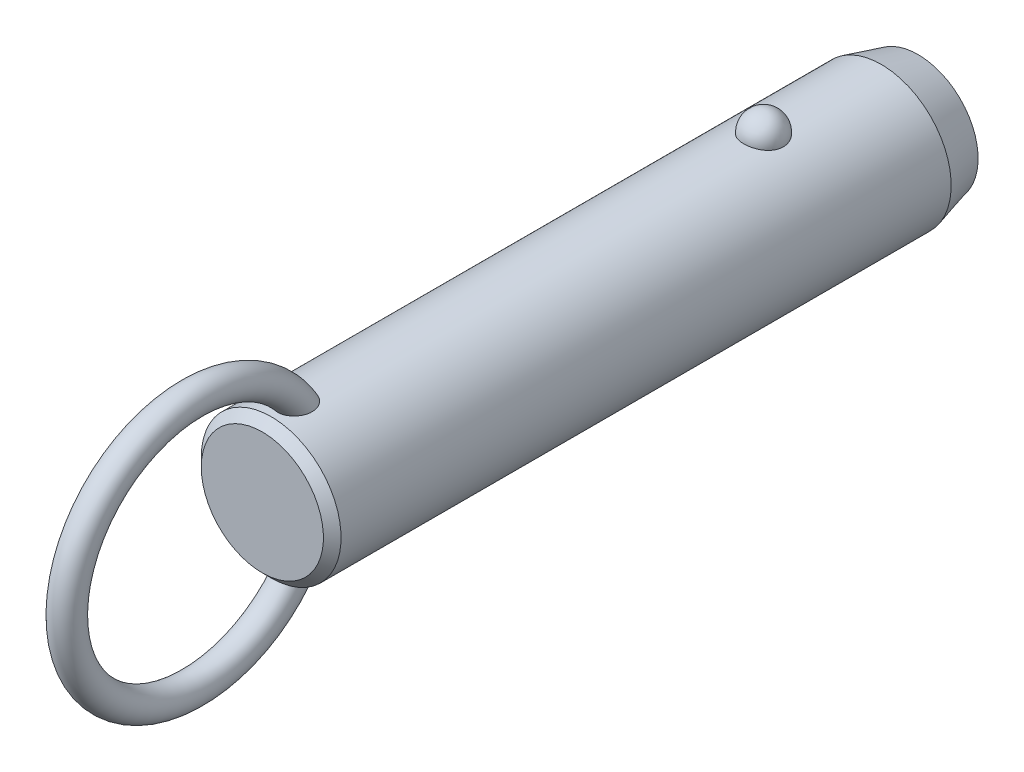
ISO-10303-21;
HEADER;
FILE_DESCRIPTION(('STEP AP214'),'2;1');
FILE_NAME('part.step','',(''),(''),'','','');
FILE_SCHEMA(('AUTOMOTIVE_DESIGN { 1 0 10303 214 1 1 1 1 }'));
ENDSEC;
DATA;
#1=APPLICATION_CONTEXT('core data for automotive mechanical design processes');
#2=APPLICATION_PROTOCOL_DEFINITION('international standard','automotive_design',2000,#1);
#3=PRODUCT_CONTEXT('',#1,'mechanical');
#4=PRODUCT('Part','Part','',(#3));
#5=PRODUCT_RELATED_PRODUCT_CATEGORY('part','',(#4));
#6=PRODUCT_DEFINITION_FORMATION('','',#4);
#7=PRODUCT_DEFINITION_CONTEXT('part definition',#1,'design');
#8=PRODUCT_DEFINITION('design','',#6,#7);
#9=PRODUCT_DEFINITION_SHAPE('','',#8);
#10=(LENGTH_UNIT() NAMED_UNIT(*) SI_UNIT(.MILLI.,.METRE.));
#11=(NAMED_UNIT(*) PLANE_ANGLE_UNIT() SI_UNIT($,.RADIAN.));
#12=(NAMED_UNIT(*) SI_UNIT($,.STERADIAN.) SOLID_ANGLE_UNIT());
#13=UNCERTAINTY_MEASURE_WITH_UNIT(LENGTH_MEASURE(1.E-05),#10,'distance_accuracy_value','');
#14=(GEOMETRIC_REPRESENTATION_CONTEXT(3) GLOBAL_UNCERTAINTY_ASSIGNED_CONTEXT((#13)) GLOBAL_UNIT_ASSIGNED_CONTEXT((#10,
#11,#12)) REPRESENTATION_CONTEXT('',''));
#15=CARTESIAN_POINT('',(0.,0.,0.));
#16=DIRECTION('',(0.,0.,1.));
#17=DIRECTION('',(1.,0.,0.));
#18=AXIS2_PLACEMENT_3D('',#15,#16,#17);
#19=CARTESIAN_POINT('',(0.,0.,55.9));
#20=DIRECTION('',(0.,0.,-1.));
#21=DIRECTION('',(-1.,0.,0.));
#22=AXIS2_PLACEMENT_3D('',#19,#20,#21);
#23=CYLINDRICAL_SURFACE('',#22,9.5);
#24=CARTESIAN_POINT('',(2.67259918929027,9.11631578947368,-2.7));
#25=CARTESIAN_POINT('',(2.6725968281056,9.11631786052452,-2.54909854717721));
#26=CARTESIAN_POINT('',(2.66030567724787,9.11994722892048,-2.39816735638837));
#27=CARTESIAN_POINT('',(2.6114347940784,9.13405924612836,-2.10058568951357));
#28=CARTESIAN_POINT('',(2.57484658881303,9.14454428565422,-1.9539367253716));
#29=CARTESIAN_POINT('',(2.47830875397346,9.17117631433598,-1.66916069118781));
#30=CARTESIAN_POINT('',(2.41836936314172,9.18732082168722,-1.53102991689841));
#31=CARTESIAN_POINT('',(2.27661331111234,9.22346780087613,-1.26705393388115));
#32=CARTESIAN_POINT('',(2.19479699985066,9.24347021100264,-1.14120852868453));
#33=CARTESIAN_POINT('',(2.01085282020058,9.28522401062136,-0.904632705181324));
#34=CARTESIAN_POINT('',(1.90862396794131,9.30698376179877,-0.79398224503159));
#35=CARTESIAN_POINT('',(1.6867437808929,9.34973971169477,-0.591607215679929));
#36=CARTESIAN_POINT('',(1.56709244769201,9.37073591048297,-0.499882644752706));
#37=CARTESIAN_POINT('',(1.31393976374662,9.40956370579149,-0.338167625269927));
#38=CARTESIAN_POINT('',(1.18048026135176,9.42740444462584,-0.268113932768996));
#39=CARTESIAN_POINT('',(0.903154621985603,9.45799906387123,-0.151390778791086));
#40=CARTESIAN_POINT('',(0.759289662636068,9.47075351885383,-0.104718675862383));
#41=CARTESIAN_POINT('',(0.468074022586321,9.48956256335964,-0.0367633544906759));
#42=CARTESIAN_POINT('',(0.320836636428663,9.49573643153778,-0.0150275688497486));
#43=CARTESIAN_POINT('',(0.0246714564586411,9.50112183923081,0.00396199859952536));
#44=CARTESIAN_POINT('',(-0.124256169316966,9.50033406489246,0.00121819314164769));
#45=CARTESIAN_POINT('',(-0.417264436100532,9.4919475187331,-0.0284441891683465));
#46=CARTESIAN_POINT('',(-0.56138413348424,9.48444885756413,-0.0550074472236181));
#47=CARTESIAN_POINT('',(-0.842986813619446,9.46357853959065,-0.131064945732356));
#48=CARTESIAN_POINT('',(-0.980469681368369,9.450206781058,-0.180559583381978));
#49=CARTESIAN_POINT('',(-1.24585005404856,9.41890822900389,-0.30147637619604));
#50=CARTESIAN_POINT('',(-1.37368611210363,9.40095498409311,-0.373026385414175));
#51=CARTESIAN_POINT('',(-1.61552738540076,9.36242964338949,-0.536025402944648));
#52=CARTESIAN_POINT('',(-1.72953116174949,9.34185727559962,-0.627476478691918));
#53=CARTESIAN_POINT('',(-1.9429225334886,9.29984568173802,-0.829844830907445));
#54=CARTESIAN_POINT('',(-2.04198021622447,9.27839736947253,-0.941108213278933));
#55=CARTESIAN_POINT('',(-2.22026460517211,9.23735994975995,-1.17883414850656));
#56=CARTESIAN_POINT('',(-2.29948985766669,9.21777097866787,-1.30529781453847));
#57=CARTESIAN_POINT('',(-2.43697287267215,9.18238994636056,-1.57158566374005));
#58=CARTESIAN_POINT('',(-2.49497068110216,9.16664569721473,-1.71155057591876));
#59=CARTESIAN_POINT('',(-2.5872073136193,9.14104303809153,-1.99961197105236));
#60=CARTESIAN_POINT('',(-2.62144683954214,9.13118445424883,-2.14770821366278));
#61=CARTESIAN_POINT('',(-2.66521466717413,9.11850622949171,-2.44715424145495));
#62=CARTESIAN_POINT('',(-2.67484831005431,9.11565658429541,-2.59848735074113));
#63=CARTESIAN_POINT('',(-2.66946735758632,9.11723375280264,-2.90067317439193));
#64=CARTESIAN_POINT('',(-2.65445345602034,9.12166036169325,-3.05152590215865));
#65=CARTESIAN_POINT('',(-2.60029711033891,9.13724422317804,-3.34766110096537));
#66=CARTESIAN_POINT('',(-2.56127978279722,9.14836656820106,-3.49296833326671));
#67=CARTESIAN_POINT('',(-2.46018844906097,9.17606676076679,-3.77477535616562));
#68=CARTESIAN_POINT('',(-2.39811349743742,9.1926448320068,-3.9112747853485));
#69=CARTESIAN_POINT('',(-2.25202303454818,9.22952198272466,-4.17244273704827));
#70=CARTESIAN_POINT('',(-2.16788714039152,9.24984129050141,-4.29704106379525));
#71=CARTESIAN_POINT('',(-1.9799408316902,9.29188255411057,-4.53013066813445));
#72=CARTESIAN_POINT('',(-1.87612963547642,9.31360456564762,-4.63862130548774));
#73=CARTESIAN_POINT('',(-1.65105429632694,9.35612959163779,-4.8369029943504));
#74=CARTESIAN_POINT('',(-1.52972405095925,9.37692871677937,-4.92661991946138));
#75=CARTESIAN_POINT('',(-1.27318250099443,9.41518970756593,-5.08429106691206));
#76=CARTESIAN_POINT('',(-1.13797219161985,9.432651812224,-5.15224684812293));
#77=CARTESIAN_POINT('',(-0.859280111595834,9.46208255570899,-5.26371827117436));
#78=CARTESIAN_POINT('',(-0.715925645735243,9.47411833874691,-5.30753421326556));
#79=CARTESIAN_POINT('',(-0.423550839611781,9.4916822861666,-5.37076321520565));
#80=CARTESIAN_POINT('',(-0.2745312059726,9.49721125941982,-5.39017930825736));
#81=CARTESIAN_POINT('',(0.0218446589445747,9.50110860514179,-5.40390587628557));
#82=CARTESIAN_POINT('',(0.16917707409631,9.49961381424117,-5.39869609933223));
#83=CARTESIAN_POINT('',(0.460808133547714,9.48993906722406,-5.3644195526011));
#84=CARTESIAN_POINT('',(0.605106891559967,9.48175936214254,-5.33535367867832));
#85=CARTESIAN_POINT('',(0.886027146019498,9.4596376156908,-5.2543558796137));
#86=CARTESIAN_POINT('',(1.02267710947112,9.44571881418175,-5.20251612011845));
#87=CARTESIAN_POINT('',(1.28523827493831,9.41358993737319,-5.07741549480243));
#88=CARTESIAN_POINT('',(1.41114877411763,9.39537958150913,-5.0041532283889));
#89=CARTESIAN_POINT('',(1.65085227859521,9.3562644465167,-4.83684599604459));
#90=CARTESIAN_POINT('',(1.76442346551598,9.33532178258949,-4.74249218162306));
#91=CARTESIAN_POINT('',(1.97425672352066,9.29321198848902,-4.53620389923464));
#92=CARTESIAN_POINT('',(2.07051582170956,9.27204482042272,-4.42426641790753));
#93=CARTESIAN_POINT('',(2.24490086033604,9.23139221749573,-4.18363183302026));
#94=CARTESIAN_POINT('',(2.32267019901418,9.21194380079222,-4.05466990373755));
#95=CARTESIAN_POINT('',(2.45584092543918,9.1773419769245,-3.78517836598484));
#96=CARTESIAN_POINT('',(2.5112497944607,9.16218713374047,-3.64465264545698));
#97=CARTESIAN_POINT('',(2.59380876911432,9.13913522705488,-3.37104301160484));
#98=CARTESIAN_POINT('',(2.62330266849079,9.13064624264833,-3.23871053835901));
#99=CARTESIAN_POINT('',(2.66269870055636,9.11923566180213,-2.97092664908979));
#100=CARTESIAN_POINT('',(2.67260130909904,9.11631393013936,-2.8354753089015));
#101=CARTESIAN_POINT('',(2.67259918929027,9.11631578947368,-2.7));
#102=B_SPLINE_CURVE_WITH_KNOTS('',3,(#24,#25,#26,#27,#28,#29,#30,#31,#32,#33,#34,#35,#36,#37,
#38,#39,#40,#41,#42,#43,#44,#45,#46,#47,#48,#49,#50,#51,#52,#53,#54,#55,#56,#57,#58,#59,#60,#61,
#62,#63,#64,#65,#66,#67,#68,#69,#70,#71,#72,#73,#74,#75,#76,#77,#78,#79,#80,#81,#82,#83,#84,#85,
#86,#87,#88,#89,#90,#91,#92,#93,#94,#95,#96,#97,#98,#99,#100,#101),.UNSPECIFIED.,.T.,.F.,(4,2,2,
2,2,2,2,2,2,2,2,2,2,2,2,2,2,2,2,2,2,2,2,2,2,2,2,2,2,2,2,2,2,2,2,2,2,2,4),(0.,0.452217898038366,
0.904593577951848,1.35677112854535,1.80894144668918,2.26340676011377,2.71787203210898,
3.17099820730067,3.62407318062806,4.0687883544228,4.51345969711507,4.95160616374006,
5.38976021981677,5.83050358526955,6.27129275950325,6.72071308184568,7.17016633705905,
7.62495278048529,8.07972578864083,8.53254856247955,8.98535859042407,9.43582813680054,
9.88631615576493,10.3393155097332,10.7923328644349,11.2471065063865,11.7018475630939,
12.150795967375,12.599688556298,13.0398725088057,13.4800399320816,13.9184421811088,
14.3568730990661,14.802202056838,15.2476074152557,15.7010097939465,16.1542603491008,
16.5602594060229,16.966248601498),.UNSPECIFIED.);
#103=CARTESIAN_POINT('',(2.67259918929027,9.11631578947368,-2.7));
#104=VERTEX_POINT('',#103);
#105=EDGE_CURVE('E41',#104,#104,#102,.T.);
#106=ORIENTED_EDGE('',*,*,#105,.T.);
#107=EDGE_LOOP('',(#106));
#108=FACE_BOUND('',#107,.T.);
#109=CARTESIAN_POINT('',(0.,0.,64.22));
#110=DIRECTION('',(0.,0.,1.));
#111=DIRECTION('',(1.,0.,0.));
#112=AXIS2_PLACEMENT_3D('',#109,#110,#111);
#113=CIRCLE('',#112,9.5);
#114=CARTESIAN_POINT('',(-9.50000000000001,0.,64.22));
#115=VERTEX_POINT('',#114);
#116=EDGE_CURVE('E10',#115,#115,#113,.F.);
#117=ORIENTED_EDGE('',*,*,#116,.T.);
#118=EDGE_LOOP('',(#117));
#119=FACE_BOUND('',#118,.T.);
#120=CARTESIAN_POINT('',(-0.697062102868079,-9.47439269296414,58.5678088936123));
#121=CARTESIAN_POINT('',(-0.799579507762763,-9.46685146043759,58.6074823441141));
#122=CARTESIAN_POINT('',(-0.898575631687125,-9.45788043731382,58.6559309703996));
#123=CARTESIAN_POINT('',(-1.08670047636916,-9.43811593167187,58.7688685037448));
#124=CARTESIAN_POINT('',(-1.17583204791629,-9.42732297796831,58.8333527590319));
#125=CARTESIAN_POINT('',(-1.34179806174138,-9.40513672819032,58.9762099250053));
#126=CARTESIAN_POINT('',(-1.41865133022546,-9.39374438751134,59.054561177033));
#127=CARTESIAN_POINT('',(-1.5586004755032,-9.37154196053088,59.2227524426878));
#128=CARTESIAN_POINT('',(-1.62169476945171,-9.3607319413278,59.3125937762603));
#129=CARTESIAN_POINT('',(-1.73527695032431,-9.34035749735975,59.5045001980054));
#130=CARTESIAN_POINT('',(-1.7852226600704,-9.33085270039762,59.6068910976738));
#131=CARTESIAN_POINT('',(-1.86924997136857,-9.3143834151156,59.818148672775));
#132=CARTESIAN_POINT('',(-1.90332570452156,-9.30741986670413,59.9270177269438));
#133=CARTESIAN_POINT('',(-1.95893603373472,-9.29588482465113,60.1604730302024));
#134=CARTESIAN_POINT('',(-1.97872420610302,-9.29165182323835,60.2854890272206));
#135=CARTESIAN_POINT('',(-2.00062129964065,-9.28695978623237,60.5370805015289));
#136=CARTESIAN_POINT('',(-2.00272284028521,-9.28650232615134,60.663656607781));
#137=CARTESIAN_POINT('',(-1.98958876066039,-9.28932750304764,60.9368157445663));
#138=CARTESIAN_POINT('',(-1.97143366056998,-9.2932400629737,61.0832519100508));
#139=CARTESIAN_POINT('',(-1.91479925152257,-9.30507151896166,61.3720629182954));
#140=CARTESIAN_POINT('',(-1.87629122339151,-9.31299607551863,61.514431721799));
#141=CARTESIAN_POINT('',(-1.7722568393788,-9.33340232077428,61.8151725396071));
#142=CARTESIAN_POINT('',(-1.70334898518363,-9.34641636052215,61.9723691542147));
#143=CARTESIAN_POINT('',(-1.58111062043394,-9.36759153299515,62.1975171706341));
#144=CARTESIAN_POINT('',(-1.53721459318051,-9.37492619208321,62.2707968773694));
#145=CARTESIAN_POINT('',(-1.4430263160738,-9.38988566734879,62.4130740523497));
#146=CARTESIAN_POINT('',(-1.39273721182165,-9.39751033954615,62.4820736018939));
#147=CARTESIAN_POINT('',(-1.26775962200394,-9.41530678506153,62.6369832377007));
#148=CARTESIAN_POINT('',(-1.19052326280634,-9.42548108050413,62.7208712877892));
#149=CARTESIAN_POINT('',(-1.0242024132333,-9.44499825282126,62.8760086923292));
#150=CARTESIAN_POINT('',(-0.935139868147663,-9.45434261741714,62.9472808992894));
#151=CARTESIAN_POINT('',(-0.766610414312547,-9.46930670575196,63.0586955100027));
#152=CARTESIAN_POINT('',(-0.689439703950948,-9.47529223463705,63.1022354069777));
#153=CARTESIAN_POINT('',(-0.528942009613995,-9.48560294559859,63.1763133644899));
#154=CARTESIAN_POINT('',(-0.445620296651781,-9.48992953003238,63.2068624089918));
#155=CARTESIAN_POINT('',(-0.273901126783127,-9.49644161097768,63.2525792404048));
#156=CARTESIAN_POINT('',(-0.185465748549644,-9.49860811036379,63.26761059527));
#157=CARTESIAN_POINT('',(-0.00734541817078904,-9.5004135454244,63.2801494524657));
#158=CARTESIAN_POINT('',(0.0823387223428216,-9.50005405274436,63.2776678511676));
#159=CARTESIAN_POINT('',(0.247679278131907,-9.49708301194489,63.2569959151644));
#160=CARTESIAN_POINT('',(0.323620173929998,-9.49477609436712,63.2409300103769));
#161=CARTESIAN_POINT('',(0.471981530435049,-9.48855917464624,63.1971726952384));
#162=CARTESIAN_POINT('',(0.544400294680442,-9.48464840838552,63.1694757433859));
#163=CARTESIAN_POINT('',(0.708947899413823,-9.47398336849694,63.0928026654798));
#164=CARTESIAN_POINT('',(0.799149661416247,-9.46671310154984,63.0397745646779));
#165=CARTESIAN_POINT('',(0.96978399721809,-9.45076225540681,62.9199731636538));
#166=CARTESIAN_POINT('',(1.05019415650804,-9.44207854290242,62.8531692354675));
#167=CARTESIAN_POINT('',(1.23092343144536,-9.42051459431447,62.6807596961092));
#168=CARTESIAN_POINT('',(1.32652499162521,-9.40733378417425,62.5702619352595));
#169=CARTESIAN_POINT('',(1.49893121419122,-9.38140745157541,62.3355614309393));
#170=CARTESIAN_POINT('',(1.57571616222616,-9.36866239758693,62.2113445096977));
#171=CARTESIAN_POINT('',(1.71285426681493,-9.34457644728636,61.9493891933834));
#172=CARTESIAN_POINT('',(1.77266365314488,-9.33328726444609,61.8113623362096));
#173=CARTESIAN_POINT('',(1.87239208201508,-9.31379209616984,61.5280515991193));
#174=CARTESIAN_POINT('',(1.91230158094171,-9.3055875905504,61.382764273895));
#175=CARTESIAN_POINT('',(1.9760418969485,-9.29228394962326,61.0620281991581));
#176=CARTESIAN_POINT('',(1.99587438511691,-9.28797202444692,60.8857248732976));
#177=CARTESIAN_POINT('',(2.0029570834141,-9.28645519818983,60.5324146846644));
#178=CARTESIAN_POINT('',(1.99025930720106,-9.28923895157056,60.3554093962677));
#179=CARTESIAN_POINT('',(1.93735479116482,-9.30038134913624,60.0563381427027));
#180=CARTESIAN_POINT('',(1.90576827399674,-9.30697680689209,59.9326679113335));
#181=CARTESIAN_POINT('',(1.82287484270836,-9.32356855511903,59.6923297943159));
#182=CARTESIAN_POINT('',(1.7715821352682,-9.33356239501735,59.5756569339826));
#183=CARTESIAN_POINT('',(1.64885744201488,-9.35602275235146,59.3527061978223));
#184=CARTESIAN_POINT('',(1.57730995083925,-9.36850332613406,59.2464927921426));
#185=CARTESIAN_POINT('',(1.41543264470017,-9.39431873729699,59.0495530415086));
#186=CARTESIAN_POINT('',(1.3251088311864,-9.40765330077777,58.9588217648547));
#187=CARTESIAN_POINT('',(1.13846223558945,-9.43195720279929,58.8050334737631));
#188=CARTESIAN_POINT('',(1.04369890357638,-9.44302894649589,58.7400947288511));
#189=CARTESIAN_POINT('',(0.843965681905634,-9.46296805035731,58.6280388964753));
#190=CARTESIAN_POINT('',(0.739000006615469,-9.4718363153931,58.5809144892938));
#191=CARTESIAN_POINT('',(0.528175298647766,-9.48586140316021,58.5081173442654));
#192=CARTESIAN_POINT('',(0.422686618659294,-9.49119633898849,58.4814024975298));
#193=CARTESIAN_POINT('',(0.208590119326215,-9.49831365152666,58.4460137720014));
#194=CARTESIAN_POINT('',(0.0999817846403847,-9.500095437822,58.4373428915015));
#195=CARTESIAN_POINT('',(-0.126104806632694,-9.49988861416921,58.4383501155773));
#196=CARTESIAN_POINT('',(-0.243578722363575,-9.49757821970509,58.4495942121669));
#197=CARTESIAN_POINT('',(-0.474390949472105,-9.48885165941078,58.493167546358));
#198=CARTESIAN_POINT('',(-0.587729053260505,-9.48243528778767,58.5254978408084));
#199=CARTESIAN_POINT('',(-0.697062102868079,-9.47439269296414,58.5678088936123));
#200=B_SPLINE_CURVE_WITH_KNOTS('',3,(#120,#121,#122,#123,#124,#125,#126,#127,#128,#129,#130,
#131,#132,#133,#134,#135,#136,#137,#138,#139,#140,#141,#142,#143,#144,#145,#146,#147,#148,#149,
#150,#151,#152,#153,#154,#155,#156,#157,#158,#159,#160,#161,#162,#163,#164,#165,#166,#167,#168,
#169,#170,#171,#172,#173,#174,#175,#176,#177,#178,#179,#180,#181,#182,#183,#184,#185,#186,#187,
#188,#189,#190,#191,#192,#193,#194,#195,#196,#197,#198,#199),.UNSPECIFIED.,.T.,.F.,(4,2,2,2,2,2,
2,2,2,2,2,2,2,2,2,2,2,2,2,2,2,2,2,2,2,2,2,2,2,2,2,2,2,2,2,2,2,2,2,4),(0.,0.330119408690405,
0.660143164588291,0.989655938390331,1.31920659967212,1.66074728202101,2.00241415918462,
2.38088696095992,2.75951768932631,3.20065679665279,3.64242004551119,4.15620996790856,
4.4131416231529,4.66994734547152,5.0122866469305,5.35399933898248,5.61943037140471,
5.88463652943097,6.15215502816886,6.41950709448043,6.65144391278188,6.88349136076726,
7.19641200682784,7.5100360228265,7.94779711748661,8.3860149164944,8.83699707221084,
9.28819530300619,9.81778662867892,10.3465317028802,10.7284172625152,11.110028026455,
11.4938603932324,11.8775702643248,12.2220189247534,12.5663259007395,12.8915939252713,
13.2169159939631,13.5689650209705,13.9210316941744),.UNSPECIFIED.);
#201=CARTESIAN_POINT('',(-0.697062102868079,-9.47439269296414,58.5678088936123));
#202=VERTEX_POINT('',#201);
#203=EDGE_CURVE('E60',#202,#202,#200,.T.);
#204=ORIENTED_EDGE('',*,*,#203,.T.);
#205=EDGE_LOOP('',(#204));
#206=FACE_BOUND('',#205,.T.);
#207=CARTESIAN_POINT('',(-0.697062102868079,9.47439269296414,58.5678088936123));
#208=CARTESIAN_POINT('',(-0.597792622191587,9.48169483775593,58.5293956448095));
#209=CARTESIAN_POINT('',(-0.495106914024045,9.48766580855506,58.4991682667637));
#210=CARTESIAN_POINT('',(-0.285876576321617,9.49627648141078,58.4560327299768));
#211=CARTESIAN_POINT('',(-0.1793245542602,9.49890941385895,58.4431597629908));
#212=CARTESIAN_POINT('',(0.0344157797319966,9.50053798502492,58.4351666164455));
#213=CARTESIAN_POINT('',(0.141603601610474,9.49953613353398,58.4400341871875));
#214=CARTESIAN_POINT('',(0.353563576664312,9.49401038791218,58.4673654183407));
#215=CARTESIAN_POINT('',(0.458336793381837,9.48948807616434,58.48982117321));
#216=CARTESIAN_POINT('',(0.662493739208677,9.4774236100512,58.5516719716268));
#217=CARTESIAN_POINT('',(0.761881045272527,9.46988348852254,58.5910556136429));
#218=CARTESIAN_POINT('',(0.952608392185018,9.45260382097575,58.6856342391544));
#219=CARTESIAN_POINT('',(1.04394806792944,9.44286417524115,58.7408299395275));
#220=CARTESIAN_POINT('',(1.21712767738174,9.4221176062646,58.8660662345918));
#221=CARTESIAN_POINT('',(1.29885671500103,9.41109835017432,58.9362579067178));
#222=CARTESIAN_POINT('',(1.4497897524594,9.38903310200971,59.088980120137));
#223=CARTESIAN_POINT('',(1.51899278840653,9.37798710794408,59.1715116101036));
#224=CARTESIAN_POINT('',(1.64602857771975,9.35654375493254,59.3497763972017));
#225=CARTESIAN_POINT('',(1.70333052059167,9.34618688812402,59.4458916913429));
#226=CARTESIAN_POINT('',(1.80259341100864,9.32755128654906,59.645897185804));
#227=CARTESIAN_POINT('',(1.84454942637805,9.31927322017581,59.7497898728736));
#228=CARTESIAN_POINT('',(1.91637039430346,9.30478365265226,59.9722131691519));
#229=CARTESIAN_POINT('',(1.944805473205,9.29882552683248,60.0912192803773));
#230=CARTESIAN_POINT('',(1.98449865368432,9.29043398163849,60.3321436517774));
#231=CARTESIAN_POINT('',(1.99574908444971,9.28800213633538,60.4540631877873));
#232=CARTESIAN_POINT('',(2.00275141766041,9.28649645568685,60.7169324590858));
#233=CARTESIAN_POINT('',(1.99588238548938,9.28799035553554,60.8579529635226));
#234=CARTESIAN_POINT('',(1.96270559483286,9.29505517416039,61.1376217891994));
#235=CARTESIAN_POINT('',(1.93637872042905,9.30063010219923,61.276267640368));
#236=CARTESIAN_POINT('',(1.85949176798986,9.31633564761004,61.5725616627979));
#237=CARTESIAN_POINT('',(1.80549792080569,9.3270926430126,61.7292907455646));
#238=CARTESIAN_POINT('',(1.67376869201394,9.3516306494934,62.0322840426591));
#239=CARTESIAN_POINT('',(1.59603181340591,9.36541185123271,62.1785475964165));
#240=CARTESIAN_POINT('',(1.43602774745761,9.39110706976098,62.4258138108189));
#241=CARTESIAN_POINT('',(1.35831795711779,9.40278656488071,62.529791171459));
#242=CARTESIAN_POINT('',(1.18774483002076,9.42585025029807,62.7245347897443));
#243=CARTESIAN_POINT('',(1.09490932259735,9.43723493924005,62.8153247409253));
#244=CARTESIAN_POINT('',(0.921110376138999,9.45552616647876,62.9562033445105));
#245=CARTESIAN_POINT('',(0.843738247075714,9.46281058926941,63.0106563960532));
#246=CARTESIAN_POINT('',(0.681245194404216,9.47589120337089,63.1067117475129));
#247=CARTESIAN_POINT('',(0.596135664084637,9.48168953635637,63.1483325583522));
#248=CARTESIAN_POINT('',(0.433779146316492,9.49038144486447,63.2100899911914));
#249=CARTESIAN_POINT('',(0.357459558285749,9.49359170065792,63.2326013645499));
#250=CARTESIAN_POINT('',(0.202074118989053,9.49816761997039,63.2645745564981));
#251=CARTESIAN_POINT('',(0.123010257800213,9.49953459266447,63.2740456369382));
#252=CARTESIAN_POINT('',(-0.0357372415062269,9.50026497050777,63.2791143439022));
#253=CARTESIAN_POINT('',(-0.115421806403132,9.49962433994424,63.2746840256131));
#254=CARTESIAN_POINT('',(-0.272823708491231,9.49640854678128,63.2522962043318));
#255=CARTESIAN_POINT('',(-0.350540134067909,9.4938325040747,63.2343325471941));
#256=CARTESIAN_POINT('',(-0.500580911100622,9.4870946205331,63.1868028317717));
#257=CARTESIAN_POINT('',(-0.572979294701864,9.48296359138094,63.1574618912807));
#258=CARTESIAN_POINT('',(-0.71286452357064,9.47347609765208,63.0890087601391));
#259=CARTESIAN_POINT('',(-0.780349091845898,9.46811906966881,63.0498920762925));
#260=CARTESIAN_POINT('',(-0.946309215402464,9.45329720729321,62.939432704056));
#261=CARTESIAN_POINT('',(-1.04090230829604,9.44321512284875,62.8623297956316));
#262=CARTESIAN_POINT('',(-1.21661929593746,9.42219227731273,62.6940971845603));
#263=CARTESIAN_POINT('',(-1.29770519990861,9.41124921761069,62.6029292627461));
#264=CARTESIAN_POINT('',(-1.47319646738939,9.38563439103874,62.3761621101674));
#265=CARTESIAN_POINT('',(-1.5620887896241,9.37102009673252,62.2362895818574));
#266=CARTESIAN_POINT('',(-1.71623987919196,9.34401559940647,61.9439503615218));
#267=CARTESIAN_POINT('',(-1.78147866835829,9.33162728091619,61.7914731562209));
#268=CARTESIAN_POINT('',(-1.88853837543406,9.31055541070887,61.4756470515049));
#269=CARTESIAN_POINT('',(-1.92998995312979,9.30193076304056,61.3121685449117));
#270=CARTESIAN_POINT('',(-1.98590726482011,9.29015757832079,60.9805268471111));
#271=CARTESIAN_POINT('',(-2.0004070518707,9.2870021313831,60.8123698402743));
#272=CARTESIAN_POINT('',(-1.99964701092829,9.28716218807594,60.5050806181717));
#273=CARTESIAN_POINT('',(-1.98908145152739,9.28945704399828,60.3659362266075));
#274=CARTESIAN_POINT('',(-1.94566294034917,9.29865169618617,60.0911539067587));
#275=CARTESIAN_POINT('',(-1.91282062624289,9.30554929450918,59.955514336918));
#276=CARTESIAN_POINT('',(-1.84582133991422,9.31898248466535,59.7578026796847));
#277=CARTESIAN_POINT('',(-1.8203808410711,9.32400364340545,59.692583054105));
#278=CARTESIAN_POINT('',(-1.7635051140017,9.33492884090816,59.5649033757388));
#279=CARTESIAN_POINT('',(-1.73207305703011,9.34083241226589,59.5024418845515));
#280=CARTESIAN_POINT('',(-1.66324243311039,9.353333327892,59.3809407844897));
#281=CARTESIAN_POINT('',(-1.62584239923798,9.35993084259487,59.3219020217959));
#282=CARTESIAN_POINT('',(-1.54527678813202,9.37356864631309,59.2079875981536));
#283=CARTESIAN_POINT('',(-1.50211241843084,9.38060884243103,59.1531110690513));
#284=CARTESIAN_POINT('',(-1.37681147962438,9.40004442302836,59.0099619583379));
#285=CARTESIAN_POINT('',(-1.28916358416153,9.41261047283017,58.9264295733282));
#286=CARTESIAN_POINT('',(-1.09996826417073,9.43658180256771,58.7772360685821));
#287=CARTESIAN_POINT('',(-0.998461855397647,9.44799034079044,58.7115238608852));
#288=CARTESIAN_POINT('',(-0.860188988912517,9.46103017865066,58.6394367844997));
#289=CARTESIAN_POINT('',(-0.828141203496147,9.46389141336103,58.6238511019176));
#290=CARTESIAN_POINT('',(-0.763210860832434,9.46934915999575,58.5944734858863));
#291=CARTESIAN_POINT('',(-0.730328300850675,9.47194567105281,58.5806815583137));
#292=CARTESIAN_POINT('',(-0.697062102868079,9.47439269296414,58.5678088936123));
#293=B_SPLINE_CURVE_WITH_KNOTS('',3,(#207,#208,#209,#210,#211,#212,#213,#214,#215,#216,#217,
#218,#219,#220,#221,#222,#223,#224,#225,#226,#227,#228,#229,#230,#231,#232,#233,#234,#235,#236,
#237,#238,#239,#240,#241,#242,#243,#244,#245,#246,#247,#248,#249,#250,#251,#252,#253,#254,#255,
#256,#257,#258,#259,#260,#261,#262,#263,#264,#265,#266,#267,#268,#269,#270,#271,#272,#273,#274,
#275,#276,#277,#278,#279,#280,#281,#282,#283,#284,#285,#286,#287,#288,#289,#290,#291,#292),
.UNSPECIFIED.,.T.,.F.,(4,2,2,2,2,2,2,2,2,2,2,2,2,2,2,2,2,2,2,2,2,2,2,2,2,2,2,2,2,2,2,2,2,2,2,2,
2,2,2,2,2,2,4),(0.,0.319942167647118,0.640532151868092,0.960900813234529,1.28112555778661,
1.60113495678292,1.92115886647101,2.24457323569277,2.56801248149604,2.90371927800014,
3.23953387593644,3.60560313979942,3.97183576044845,4.39383693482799,4.81625324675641,
5.31257045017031,5.80891895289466,6.19868344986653,6.58773876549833,6.87145417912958,
7.15475838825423,7.3926375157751,7.63034760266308,7.86853584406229,8.10683246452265,
8.3406366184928,8.57454843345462,8.93983939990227,9.30614105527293,9.80266668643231,
10.2996107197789,10.8040753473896,11.3079021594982,11.7249776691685,12.1418541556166,
12.3521485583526,12.562331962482,12.7725671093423,12.9827582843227,13.3458276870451,
13.7078449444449,13.8150604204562,13.9222762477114),.UNSPECIFIED.);
#294=CARTESIAN_POINT('',(-0.697062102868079,9.47439269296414,58.5678088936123));
#295=VERTEX_POINT('',#294);
#296=EDGE_CURVE('E67',#295,#295,#293,.T.);
#297=ORIENTED_EDGE('',*,*,#296,.T.);
#298=EDGE_LOOP('',(#297));
#299=FACE_BOUND('',#298,.T.);
#300=CARTESIAN_POINT('',(0.,0.,-18.6999999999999));
#301=DIRECTION('',(0.,0.,-1.));
#302=DIRECTION('',(-1.,0.,0.));
#303=AXIS2_PLACEMENT_3D('',#300,#301,#302);
#304=CIRCLE('',#303,9.5);
#305=CARTESIAN_POINT('',(-9.5,0.,-18.6999999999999));
#306=VERTEX_POINT('',#305);
#307=EDGE_CURVE('E57',#306,#306,#304,.F.);
#308=ORIENTED_EDGE('',*,*,#307,.T.);
#309=EDGE_LOOP('',(#308));
#310=FACE_BOUND('',#309,.T.);
#311=ADVANCED_FACE('F37',(#108,#119,#206,#299,#310),#23,.T.);
#312=CARTESIAN_POINT('',(0.,0.,-23.7));
#313=DIRECTION('',(0.,0.,-1.));
#314=DIRECTION('',(-1.,0.,0.));
#315=AXIS2_PLACEMENT_3D('',#312,#313,#314);
#316=PLANE('',#315);
#317=CARTESIAN_POINT('',(0.,0.,-23.7));
#318=DIRECTION('',(0.,0.,-1.));
#319=DIRECTION('',(-1.,0.,0.));
#320=AXIS2_PLACEMENT_3D('',#317,#318,#319);
#321=CIRCLE('',#320,8.16025403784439);
#322=CARTESIAN_POINT('',(-8.16025403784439,0.,-23.7));
#323=VERTEX_POINT('',#322);
#324=EDGE_CURVE('E66',#323,#323,#321,.T.);
#325=ORIENTED_EDGE('',*,*,#324,.T.);
#326=EDGE_LOOP('',(#325));
#327=FACE_BOUND('',#326,.T.);
#328=ADVANCED_FACE('F85',(#327),#316,.T.);
#329=CARTESIAN_POINT('',(0.,0.,-23.7));
#330=DIRECTION('',(0.,0.,1.));
#331=DIRECTION('',(1.,0.,0.));
#332=AXIS2_PLACEMENT_3D('',#329,#330,#331);
#333=CONICAL_SURFACE('',#332,8.16025403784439,0.261799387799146);
#334=ORIENTED_EDGE('',*,*,#307,.F.);
#335=EDGE_LOOP('',(#334));
#336=FACE_BOUND('',#335,.T.);
#337=ORIENTED_EDGE('',*,*,#324,.F.);
#338=EDGE_LOOP('',(#337));
#339=FACE_BOUND('',#338,.T.);
#340=ADVANCED_FACE('F83',(#336,#339),#333,.T.);
#341=CARTESIAN_POINT('',(0.,0.,65.42));
#342=DIRECTION('',(0.,0.,1.));
#343=DIRECTION('',(1.,0.,0.));
#344=AXIS2_PLACEMENT_3D('',#341,#342,#343);
#345=PLANE('',#344);
#346=CARTESIAN_POINT('',(0.,0.,65.42));
#347=DIRECTION('',(0.,0.,1.));
#348=DIRECTION('',(1.,0.,0.));
#349=AXIS2_PLACEMENT_3D('',#346,#347,#348);
#350=CIRCLE('',#349,8.29999999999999);
#351=CARTESIAN_POINT('',(-8.3,0.,65.42));
#352=VERTEX_POINT('',#351);
#353=EDGE_CURVE('E50',#352,#352,#350,.T.);
#354=ORIENTED_EDGE('',*,*,#353,.T.);
#355=EDGE_LOOP('',(#354));
#356=FACE_BOUND('',#355,.T.);
#357=ADVANCED_FACE('F77',(#356),#345,.T.);
#358=CARTESIAN_POINT('',(0.,0.,74.95));
#359=DIRECTION('',(1.,0.,0.));
#360=DIRECTION('',(0.,0.,-1.));
#361=AXIS2_PLACEMENT_3D('',#358,#359,#360);
#362=TOROIDAL_SURFACE('',#361,17.05,2.);
#363=ORIENTED_EDGE('',*,*,#296,.F.);
#364=EDGE_LOOP('',(#363));
#365=FACE_BOUND('',#364,.T.);
#366=ORIENTED_EDGE('',*,*,#203,.F.);
#367=EDGE_LOOP('',(#366));
#368=FACE_BOUND('',#367,.T.);
#369=ADVANCED_FACE('F73',(#365,#368),#362,.T.);
#370=CARTESIAN_POINT('',(0.,0.,65.42));
#371=DIRECTION('',(0.,0.,-1.));
#372=DIRECTION('',(-1.,0.,0.));
#373=AXIS2_PLACEMENT_3D('',#370,#371,#372);
#374=CONICAL_SURFACE('',#373,8.29999999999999,0.785398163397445);
#375=CARTESIAN_POINT('',(-9.50000000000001,0.,64.22));
#376=CARTESIAN_POINT('',(-9.48750000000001,0.,64.2325));
#377=CARTESIAN_POINT('',(-9.47500000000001,0.,64.245));
#378=CARTESIAN_POINT('',(-9.45000000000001,0.,64.27));
#379=CARTESIAN_POINT('',(-9.43750000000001,0.,64.2825));
#380=CARTESIAN_POINT('',(-9.41250000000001,0.,64.3075));
#381=CARTESIAN_POINT('',(-9.40000000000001,0.,64.32));
#382=CARTESIAN_POINT('',(-9.37500000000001,0.,64.345));
#383=CARTESIAN_POINT('',(-9.36250000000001,0.,64.3575));
#384=CARTESIAN_POINT('',(-9.3375,0.,64.3825));
#385=CARTESIAN_POINT('',(-9.325,0.,64.395));
#386=CARTESIAN_POINT('',(-9.3,0.,64.42));
#387=CARTESIAN_POINT('',(-9.2875,0.,64.4325));
#388=CARTESIAN_POINT('',(-9.26250000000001,0.,64.4575));
#389=CARTESIAN_POINT('',(-9.25000000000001,0.,64.47));
#390=CARTESIAN_POINT('',(-9.225,0.,64.495));
#391=CARTESIAN_POINT('',(-9.2125,0.,64.5075));
#392=CARTESIAN_POINT('',(-9.1875,0.,64.5325));
#393=CARTESIAN_POINT('',(-9.175,0.,64.545));
#394=CARTESIAN_POINT('',(-9.15000000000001,0.,64.57));
#395=CARTESIAN_POINT('',(-9.1375,0.,64.5825));
#396=CARTESIAN_POINT('',(-9.1125,0.,64.6075));
#397=CARTESIAN_POINT('',(-9.1,0.,64.62));
#398=CARTESIAN_POINT('',(-9.075,0.,64.645));
#399=CARTESIAN_POINT('',(-9.06250000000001,0.,64.6575));
#400=CARTESIAN_POINT('',(-9.0375,0.,64.6825));
#401=CARTESIAN_POINT('',(-9.025,0.,64.695));
#402=CARTESIAN_POINT('',(-9.,0.,64.72));
#403=CARTESIAN_POINT('',(-8.9875,0.,64.7325));
#404=CARTESIAN_POINT('',(-8.9625,0.,64.7575));
#405=CARTESIAN_POINT('',(-8.95,0.,64.77));
#406=CARTESIAN_POINT('',(-8.925,0.,64.795));
#407=CARTESIAN_POINT('',(-8.9125,0.,64.8075));
#408=CARTESIAN_POINT('',(-8.8875,0.,64.8325));
#409=CARTESIAN_POINT('',(-8.875,0.,64.845));
#410=CARTESIAN_POINT('',(-8.85,0.,64.87));
#411=CARTESIAN_POINT('',(-8.8375,0.,64.8825));
#412=CARTESIAN_POINT('',(-8.8125,0.,64.9075));
#413=CARTESIAN_POINT('',(-8.8,0.,64.92));
#414=CARTESIAN_POINT('',(-8.775,0.,64.945));
#415=CARTESIAN_POINT('',(-8.7625,0.,64.9575));
#416=CARTESIAN_POINT('',(-8.7375,0.,64.9825));
#417=CARTESIAN_POINT('',(-8.725,0.,64.995));
#418=CARTESIAN_POINT('',(-8.7,0.,65.02));
#419=CARTESIAN_POINT('',(-8.6875,0.,65.0325));
#420=CARTESIAN_POINT('',(-8.6625,0.,65.0575));
#421=CARTESIAN_POINT('',(-8.65,0.,65.07));
#422=CARTESIAN_POINT('',(-8.625,0.,65.095));
#423=CARTESIAN_POINT('',(-8.6125,0.,65.1075));
#424=CARTESIAN_POINT('',(-8.5875,0.,65.1325));
#425=CARTESIAN_POINT('',(-8.575,0.,65.145));
#426=CARTESIAN_POINT('',(-8.55,0.,65.17));
#427=CARTESIAN_POINT('',(-8.5375,0.,65.1825));
#428=CARTESIAN_POINT('',(-8.5125,0.,65.2075));
#429=CARTESIAN_POINT('',(-8.5,0.,65.22));
#430=CARTESIAN_POINT('',(-8.475,0.,65.245));
#431=CARTESIAN_POINT('',(-8.4625,0.,65.2575));
#432=CARTESIAN_POINT('',(-8.43749999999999,0.,65.2825));
#433=CARTESIAN_POINT('',(-8.425,0.,65.295));
#434=CARTESIAN_POINT('',(-8.4,0.,65.32));
#435=CARTESIAN_POINT('',(-8.3875,0.,65.3325));
#436=CARTESIAN_POINT('',(-8.3625,0.,65.3575));
#437=CARTESIAN_POINT('',(-8.35,0.,65.37));
#438=CARTESIAN_POINT('',(-8.32499999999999,0.,65.395));
#439=CARTESIAN_POINT('',(-8.31249999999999,0.,65.4075));
#440=CARTESIAN_POINT('',(-8.3,0.,65.42));
#441=B_SPLINE_CURVE_WITH_KNOTS('',3,(#375,#376,#377,#378,#379,#380,#381,#382,#383,#384,#385,
#386,#387,#388,#389,#390,#391,#392,#393,#394,#395,#396,#397,#398,#399,#400,#401,#402,#403,#404,
#405,#406,#407,#408,#409,#410,#411,#412,#413,#414,#415,#416,#417,#418,#419,#420,#421,#422,#423,
#424,#425,#426,#427,#428,#429,#430,#431,#432,#433,#434,#435,#436,#437,#438,#439,#440),
.UNSPECIFIED.,.F.,.F.,(4,2,2,2,2,2,2,2,2,2,2,2,2,2,2,2,2,2,2,2,2,2,2,2,2,2,2,2,2,2,2,2,4),(0.,
0.0530330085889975,0.106066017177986,0.159099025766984,0.212132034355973,0.265165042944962,
0.318198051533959,0.371231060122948,0.424264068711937,0.477297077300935,0.530330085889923,
0.583363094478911,0.63639610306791,0.689429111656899,0.742462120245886,0.795495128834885,
0.848528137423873,0.901561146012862,0.95459415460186,1.00762716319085,1.06066017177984,
1.11369318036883,1.16672618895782,1.21975919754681,1.27279220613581,1.3258252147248,
1.37885822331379,1.43189123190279,1.48492424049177,1.53795724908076,1.59099025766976,
1.64402326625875,1.69705627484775),.UNSPECIFIED.);
#442=EDGE_CURVE('BSEAM39',#115,#352,#441,.T.);
#443=ORIENTED_EDGE('',*,*,#116,.F.);
#444=ORIENTED_EDGE('',*,*,#353,.F.);
#445=ORIENTED_EDGE('',*,*,#442,.T.);
#446=ORIENTED_EDGE('',*,*,#442,.F.);
#447=EDGE_LOOP('',(#443,#445,#444,#446));
#448=FACE_BOUND('',#447,.T.);
#449=ADVANCED_FACE('F39',(#448),#374,.T.);
#450=CARTESIAN_POINT('',(0.,9.5,-2.7));
#451=DIRECTION('',(0.,1.,0.));
#452=DIRECTION('',(0.,0.,-1.));
#453=AXIS2_PLACEMENT_3D('',#450,#451,#452);
#454=SPHERICAL_SURFACE('',#453,2.7);
#455=ORIENTED_EDGE('',*,*,#105,.F.);
#456=EDGE_LOOP('',(#455));
#457=FACE_BOUND('',#456,.T.);
#458=ADVANCED_FACE('F79',(#457),#454,.T.);
#459=CLOSED_SHELL('',(#311,#328,#340,#357,#369,#449,#458));
#460=MANIFOLD_SOLID_BREP('B2',#459);
#461=ADVANCED_BREP_SHAPE_REPRESENTATION('',(#18,#460),#14);
#462=SHAPE_DEFINITION_REPRESENTATION(#9,#461);
ENDSEC;
END-ISO-10303-21;
